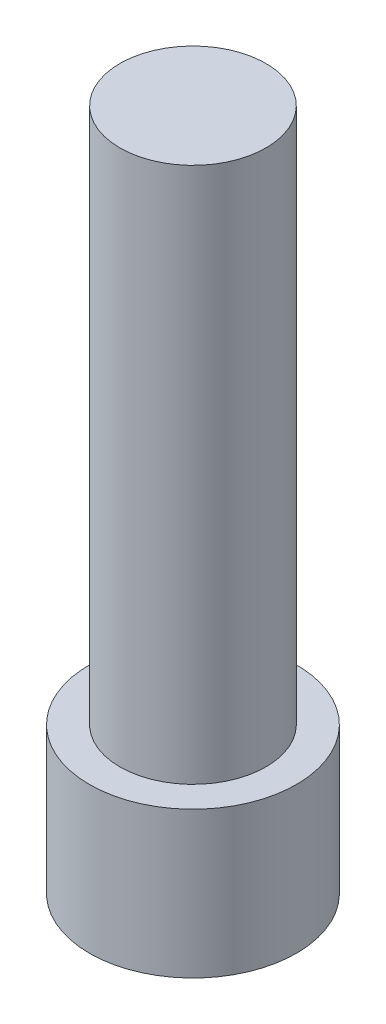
from build123d import *

# Parameters (mm, degrees)
SKETCH_1_R          = 4.25
EXTRUDE_1_DEPTH     = 6
SKETCH_2_R          = 3
EXTRUDE_2_DEPTH     = 22
CUT_EXTRUDE_1_DEPTH = 3


with BuildPart() as part:
    # Sketch 1 → Extrude 1 (new body)
    with BuildSketch(Plane(origin=(0, 0, 0), x_dir=(1, 0, 0), z_dir=(0, 1, 0))):
        with Locations(Location((0, 0, 0), (0, 0, 270))):
            Circle(SKETCH_1_R)
    extrude(amount=EXTRUDE_1_DEPTH)

    # Sketch 2 → Extrude 2 (add)
    with BuildSketch(Plane(origin=(0, 6, 0), x_dir=(1, 0, 0), z_dir=(0, 1, 0))):
        with Locations(Location((0, 0, 0), (0, 0, 270))):
            Circle(SKETCH_2_R)
    extrude(amount=EXTRUDE_2_DEPTH)

    # Sketch 3 → Cut-Extrude 1 (cut)
    with BuildSketch(Plane.XZ):
        Polygon((2.357121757, -1.666526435), (2.621815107, 1.208064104), (0.26469335, 2.874590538), (-2.357121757, 1.666526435), (-2.621815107, -1.208064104), (-0.26469335, -2.874590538), align=None)
    extrude(amount=-CUT_EXTRUDE_1_DEPTH, mode=Mode.SUBTRACT)


solid = part.part
